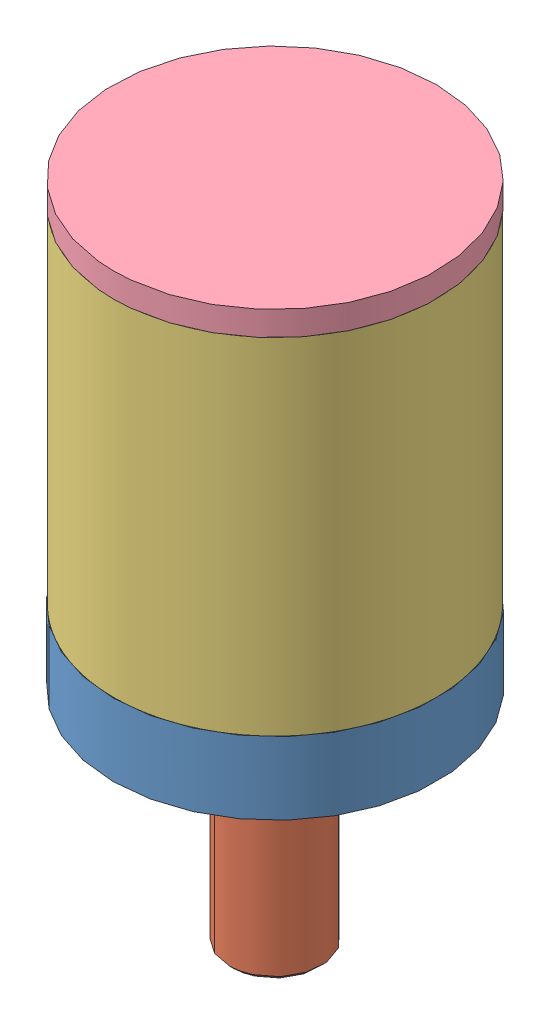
SolidWorks assembly Gear box.sldasm, configuration Default (file format 6000). Lengths in mm.
Overall size (42 86.11 42).
4 component instances, 4 part files, 6 mates.
Components (placement in the parent):
- Gear end cap1-1: Gear end cap1.sldprt [Default] at origin size (42 17.27 42)
- gear shaft-1: gear shaft.sldprt [pump shaft] at (0 20.9348 0) x (-0.972968 0 0.23094) z (0.23094 0 0.972968) size (34 49.64 34)
- gear housing1-1: gear housing1.sldprt [Default] at (0 9.398 0) size (41.78 44.83 41.78)
- gear end cap2-1: gear end cap2.sldprt [Default] at (0 54.229 0) size (41.91 3.17 41.91)
Mates (geometry in assembly coordinates):
- Concentric1: concentric anti-aligned: cylinder of Gear end cap1-1 through (0 14.2748 0) axis (0 -1 0) radius 6; cylinder of gear shaft-1 through (0 -28.7052 0) axis (0 1 0) radius 5.985
- Coincident2: coincident anti-aligned: plane of Gear end cap1-1 through (0 14.2748 0) normal (0 1 0); plane of gear shaft-1 through (0 14.2748 0) normal (0 -1 0)
- Coincident3: coincident anti-aligned: plane of Gear end cap1-1 through (0 9.398 0) normal (0 1 0); plane of gear housing1-1 through (0 9.398 0) normal (0 -1 0)
- Concentric2: concentric anti-aligned: cylinder of Gear end cap1-1 through (0 9.398 0) axis (0 1 0) radius 19.5961; cylinder of gear housing1-1 through (0 54.229 0) axis (0 -1 0) radius 19.558
- Coincident4: coincident anti-aligned: plane of gear housing1-1 through (0 54.229 0) normal (0 1 0); plane of gear end cap2-1 through (0 54.229 0) normal (0 -1 0)
- Concentric3: concentric aligned: cylinder of gear housing1-1 through (0 54.229 0) axis (0 -1 0) radius 20.8915; cylinder of gear end cap2-1 through (0 57.404 0) axis (0 -1 0) radius 20.955
